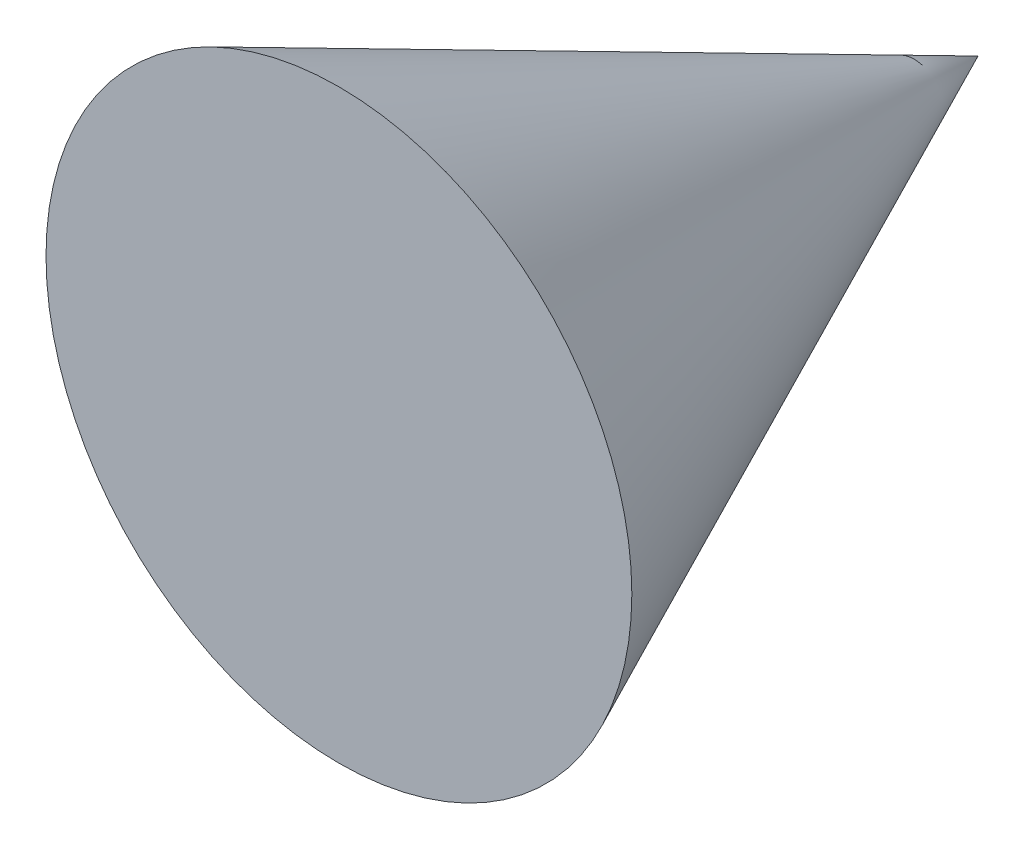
from build123d import *


with BuildPart() as part:
    # Sketch 1 → Revolve 1 (revolve)
    with BuildSketch(Plane(origin=(0, 0, 0), x_dir=(1, 0, 0), z_dir=(0, 1, 0)), mode=Mode.PRIVATE) as revolve_1_sk:
        Polygon((0, 35.157639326), (-25, -19.385921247), (0, -19.385921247), align=None)
    revolve(revolve_1_sk.sketch.rotate(Axis((0, 0, -52.667647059), (0, 0, 1)), 180), axis=Axis((0, 0, -52.667647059), (0, 0, 1)))


solid = part.part
